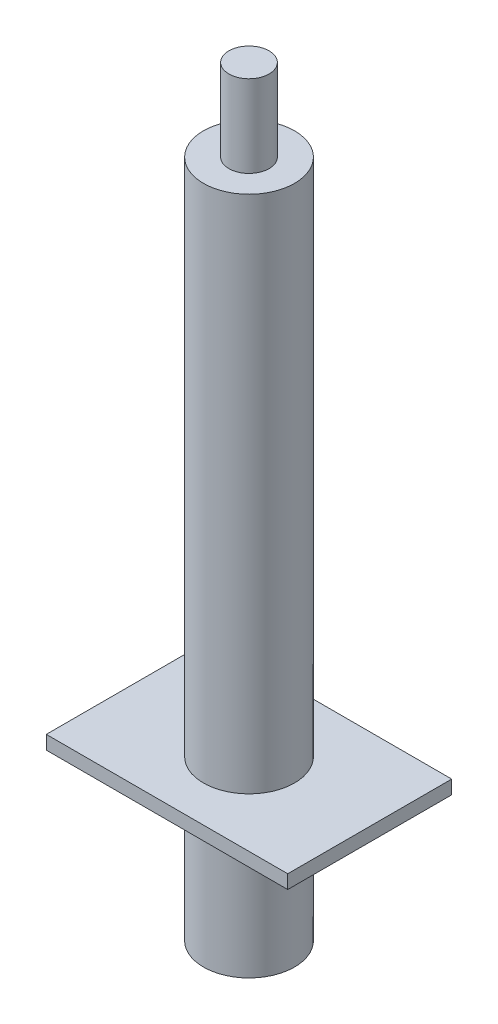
from build123d import *

# Parameters (mm, degrees)
SKETCH_1_R      = 5
EXTRUDE_1_DEPTH = 57
SKETCH_2_R      = 2.203766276
EXTRUDE_3_DEPTH = 9
SKETCH_3_W      = 26.5
SKETCH_3_H      = 18
EXTRUDE_4_DEPTH = 1.5
EXTRUDE_START   = 16
SKETCH_5_R      = 5
EXTRUDE_5_DEPTH = 16


with BuildPart() as part:
    # Sketch 1 → Extrude 1 (new body)
    with BuildSketch(Plane(origin=(0, 0, 0), x_dir=(1, 0, 0), z_dir=(0, 1, 0))):
        with Locations(Location((0, 0, 0), (0, 0, 90))):
            Circle(SKETCH_1_R)
    extrude(amount=EXTRUDE_1_DEPTH)

    # Sketch 2 → Extrude 3 (add)
    with BuildSketch(Plane(origin=(0, 57, 0), x_dir=(1, 0, 0), z_dir=(0, 1, 0))):
        with Locations(Location((0, 0, 0), (0, 0, 270))):
            Circle(SKETCH_2_R)
    extrude(amount=EXTRUDE_3_DEPTH)

    # Sketch 3 → Extrude 4 (add)
    with BuildSketch(Plane.XZ):
        Rectangle(SKETCH_3_W, SKETCH_3_H)
    extrude(amount=EXTRUDE_4_DEPTH)

    # Sketch 5 → Extrude 5 (add)
    with BuildSketch(Plane.XZ.offset(1.5).offset(EXTRUDE_START)):
        with Locations(Location((0, 0, 0), (0, 0, 270))):
            Circle(SKETCH_5_R)
    extrude(amount=-EXTRUDE_5_DEPTH)


solid = part.part
